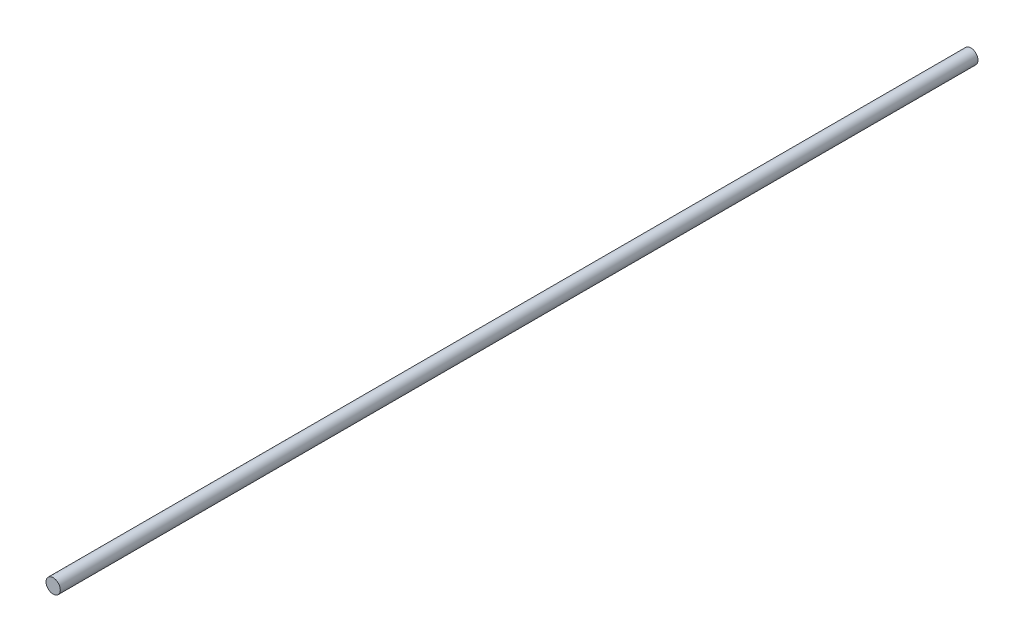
ISO-10303-21;
HEADER;
FILE_DESCRIPTION(('STEP AP214'),'2;1');
FILE_NAME('part.step','',(''),(''),'','','');
FILE_SCHEMA(('AUTOMOTIVE_DESIGN { 1 0 10303 214 1 1 1 1 }'));
ENDSEC;
DATA;
#1=APPLICATION_CONTEXT('core data for automotive mechanical design processes');
#2=APPLICATION_PROTOCOL_DEFINITION('international standard','automotive_design',2000,#1);
#3=PRODUCT_CONTEXT('',#1,'mechanical');
#4=PRODUCT('Part','Part','',(#3));
#5=PRODUCT_RELATED_PRODUCT_CATEGORY('part','',(#4));
#6=PRODUCT_DEFINITION_FORMATION('','',#4);
#7=PRODUCT_DEFINITION_CONTEXT('part definition',#1,'design');
#8=PRODUCT_DEFINITION('design','',#6,#7);
#9=PRODUCT_DEFINITION_SHAPE('','',#8);
#10=(LENGTH_UNIT() NAMED_UNIT(*) SI_UNIT(.MILLI.,.METRE.));
#11=(NAMED_UNIT(*) PLANE_ANGLE_UNIT() SI_UNIT($,.RADIAN.));
#12=(NAMED_UNIT(*) SI_UNIT($,.STERADIAN.) SOLID_ANGLE_UNIT());
#13=UNCERTAINTY_MEASURE_WITH_UNIT(LENGTH_MEASURE(1.E-05),#10,'distance_accuracy_value','');
#14=(GEOMETRIC_REPRESENTATION_CONTEXT(3) GLOBAL_UNCERTAINTY_ASSIGNED_CONTEXT((#13)) GLOBAL_UNIT_ASSIGNED_CONTEXT((#10,
#11,#12)) REPRESENTATION_CONTEXT('',''));
#15=CARTESIAN_POINT('',(0.,0.,0.));
#16=DIRECTION('',(0.,0.,1.));
#17=DIRECTION('',(1.,0.,0.));
#18=AXIS2_PLACEMENT_3D('',#15,#16,#17);
#19=CARTESIAN_POINT('',(0.,0.,-3850.));
#20=DIRECTION('',(0.,0.,1.));
#21=DIRECTION('',(1.,0.,0.));
#22=AXIS2_PLACEMENT_3D('',#19,#20,#21);
#23=CYLINDRICAL_SURFACE('',#22,30.);
#24=CARTESIAN_POINT('',(0.,0.,-3850.));
#25=DIRECTION('',(0.,0.,1.));
#26=DIRECTION('',(1.,0.,0.));
#27=AXIS2_PLACEMENT_3D('',#24,#25,#26);
#28=CIRCLE('',#27,30.);
#29=CARTESIAN_POINT('',(30.,0.,-3850.));
#30=VERTEX_POINT('',#29);
#31=EDGE_CURVE('E10',#30,#30,#28,.T.);
#32=CARTESIAN_POINT('',(0.,0.,0.));
#33=DIRECTION('',(0.,0.,1.));
#34=DIRECTION('',(1.,0.,0.));
#35=AXIS2_PLACEMENT_3D('',#32,#33,#34);
#36=CIRCLE('',#35,30.);
#37=CARTESIAN_POINT('',(30.,0.,0.));
#38=VERTEX_POINT('',#37);
#39=EDGE_CURVE('E40',#38,#38,#36,.T.);
#40=CARTESIAN_POINT('',(30.,0.,-3850.));
#41=CARTESIAN_POINT('',(30.,0.,-3809.89583333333));
#42=CARTESIAN_POINT('',(30.,0.,-3769.79166666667));
#43=CARTESIAN_POINT('',(30.,0.,-3689.58333333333));
#44=CARTESIAN_POINT('',(30.,0.,-3649.47916666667));
#45=CARTESIAN_POINT('',(30.,0.,-3569.27083333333));
#46=CARTESIAN_POINT('',(30.,0.,-3529.16666666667));
#47=CARTESIAN_POINT('',(30.,0.,-3448.95833333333));
#48=CARTESIAN_POINT('',(30.,0.,-3408.85416666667));
#49=CARTESIAN_POINT('',(30.,0.,-3328.64583333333));
#50=CARTESIAN_POINT('',(30.,0.,-3288.54166666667));
#51=CARTESIAN_POINT('',(30.,0.,-3208.33333333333));
#52=CARTESIAN_POINT('',(30.,0.,-3168.22916666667));
#53=CARTESIAN_POINT('',(30.,0.,-3088.02083333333));
#54=CARTESIAN_POINT('',(30.,0.,-3047.91666666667));
#55=CARTESIAN_POINT('',(30.,0.,-2967.70833333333));
#56=CARTESIAN_POINT('',(30.,0.,-2927.60416666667));
#57=CARTESIAN_POINT('',(30.,0.,-2847.39583333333));
#58=CARTESIAN_POINT('',(30.,0.,-2807.29166666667));
#59=CARTESIAN_POINT('',(30.,0.,-2727.08333333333));
#60=CARTESIAN_POINT('',(30.,0.,-2686.97916666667));
#61=CARTESIAN_POINT('',(30.,0.,-2606.77083333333));
#62=CARTESIAN_POINT('',(30.,0.,-2566.66666666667));
#63=CARTESIAN_POINT('',(30.,0.,-2486.45833333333));
#64=CARTESIAN_POINT('',(30.,0.,-2446.35416666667));
#65=CARTESIAN_POINT('',(30.,0.,-2366.14583333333));
#66=CARTESIAN_POINT('',(30.,0.,-2326.04166666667));
#67=CARTESIAN_POINT('',(30.,0.,-2245.83333333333));
#68=CARTESIAN_POINT('',(30.,0.,-2205.72916666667));
#69=CARTESIAN_POINT('',(30.,0.,-2125.52083333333));
#70=CARTESIAN_POINT('',(30.,0.,-2085.41666666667));
#71=CARTESIAN_POINT('',(30.,0.,-2005.20833333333));
#72=CARTESIAN_POINT('',(30.,0.,-1965.10416666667));
#73=CARTESIAN_POINT('',(30.,0.,-1884.89583333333));
#74=CARTESIAN_POINT('',(30.,0.,-1844.79166666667));
#75=CARTESIAN_POINT('',(30.,0.,-1764.58333333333));
#76=CARTESIAN_POINT('',(30.,0.,-1724.47916666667));
#77=CARTESIAN_POINT('',(30.,0.,-1644.27083333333));
#78=CARTESIAN_POINT('',(30.,0.,-1604.16666666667));
#79=CARTESIAN_POINT('',(30.,0.,-1523.95833333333));
#80=CARTESIAN_POINT('',(30.,0.,-1483.85416666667));
#81=CARTESIAN_POINT('',(30.,0.,-1403.64583333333));
#82=CARTESIAN_POINT('',(30.,0.,-1363.54166666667));
#83=CARTESIAN_POINT('',(30.,0.,-1283.33333333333));
#84=CARTESIAN_POINT('',(30.,0.,-1243.22916666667));
#85=CARTESIAN_POINT('',(30.,0.,-1163.02083333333));
#86=CARTESIAN_POINT('',(30.,0.,-1122.91666666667));
#87=CARTESIAN_POINT('',(30.,0.,-1042.70833333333));
#88=CARTESIAN_POINT('',(30.,0.,-1002.60416666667));
#89=CARTESIAN_POINT('',(30.,0.,-922.395833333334));
#90=CARTESIAN_POINT('',(30.,0.,-882.291666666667));
#91=CARTESIAN_POINT('',(30.,0.,-802.083333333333));
#92=CARTESIAN_POINT('',(30.,0.,-761.979166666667));
#93=CARTESIAN_POINT('',(30.,0.,-681.770833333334));
#94=CARTESIAN_POINT('',(30.,0.,-641.666666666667));
#95=CARTESIAN_POINT('',(30.,0.,-561.458333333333));
#96=CARTESIAN_POINT('',(30.,0.,-521.354166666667));
#97=CARTESIAN_POINT('',(30.,0.,-441.145833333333));
#98=CARTESIAN_POINT('',(30.,0.,-401.041666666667));
#99=CARTESIAN_POINT('',(30.,0.,-320.833333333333));
#100=CARTESIAN_POINT('',(30.,0.,-280.729166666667));
#101=CARTESIAN_POINT('',(30.,0.,-200.520833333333));
#102=CARTESIAN_POINT('',(30.,0.,-160.416666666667));
#103=CARTESIAN_POINT('',(30.,0.,-80.2083333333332));
#104=CARTESIAN_POINT('',(30.,0.,-40.1041666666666));
#105=CARTESIAN_POINT('',(30.,0.,0.));
#106=B_SPLINE_CURVE_WITH_KNOTS('',3,(#40,#41,#42,#43,#44,#45,#46,#47,#48,#49,#50,#51,#52,#53,
#54,#55,#56,#57,#58,#59,#60,#61,#62,#63,#64,#65,#66,#67,#68,#69,#70,#71,#72,#73,#74,#75,#76,#77,
#78,#79,#80,#81,#82,#83,#84,#85,#86,#87,#88,#89,#90,#91,#92,#93,#94,#95,#96,#97,#98,#99,#100,
#101,#102,#103,#104,#105),.UNSPECIFIED.,.F.,.F.,(4,2,2,2,2,2,2,2,2,2,2,2,2,2,2,2,2,2,2,2,2,2,2,
2,2,2,2,2,2,2,2,2,4),(0.,120.3125,240.625,360.9375,481.25,601.5625,721.875,842.187500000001,
962.5,1082.8125,1203.125,1323.4375,1443.75,1564.0625,1684.375,1804.6875,1925.,2045.3125,
2165.625,2285.9375,2406.25,2526.5625,2646.875,2767.1875,2887.5,3007.8125,3128.125,3248.4375,
3368.75,3489.0625,3609.375,3729.6875,3850.),.UNSPECIFIED.);
#107=EDGE_CURVE('BSEAM37',#30,#38,#106,.T.);
#108=ORIENTED_EDGE('',*,*,#31,.T.);
#109=ORIENTED_EDGE('',*,*,#39,.F.);
#110=ORIENTED_EDGE('',*,*,#107,.T.);
#111=ORIENTED_EDGE('',*,*,#107,.F.);
#112=EDGE_LOOP('',(#108,#110,#109,#111));
#113=FACE_BOUND('',#112,.T.);
#114=ADVANCED_FACE('F37',(#113),#23,.T.);
#115=CARTESIAN_POINT('',(0.,0.,-3850.));
#116=DIRECTION('',(0.,0.,1.));
#117=DIRECTION('',(1.,0.,0.));
#118=AXIS2_PLACEMENT_3D('',#115,#116,#117);
#119=PLANE('',#118);
#120=ORIENTED_EDGE('',*,*,#31,.F.);
#121=EDGE_LOOP('',(#120));
#122=FACE_BOUND('',#121,.T.);
#123=ADVANCED_FACE('F54',(#122),#119,.F.);
#124=CARTESIAN_POINT('',(0.,0.,0.));
#125=DIRECTION('',(0.,0.,1.));
#126=DIRECTION('',(1.,0.,0.));
#127=AXIS2_PLACEMENT_3D('',#124,#125,#126);
#128=PLANE('',#127);
#129=ORIENTED_EDGE('',*,*,#39,.T.);
#130=EDGE_LOOP('',(#129));
#131=FACE_BOUND('',#130,.T.);
#132=ADVANCED_FACE('F51',(#131),#128,.T.);
#133=CLOSED_SHELL('',(#114,#123,#132));
#134=MANIFOLD_SOLID_BREP('B2',#133);
#135=ADVANCED_BREP_SHAPE_REPRESENTATION('',(#18,#134),#14);
#136=SHAPE_DEFINITION_REPRESENTATION(#9,#135);
ENDSEC;
END-ISO-10303-21;
